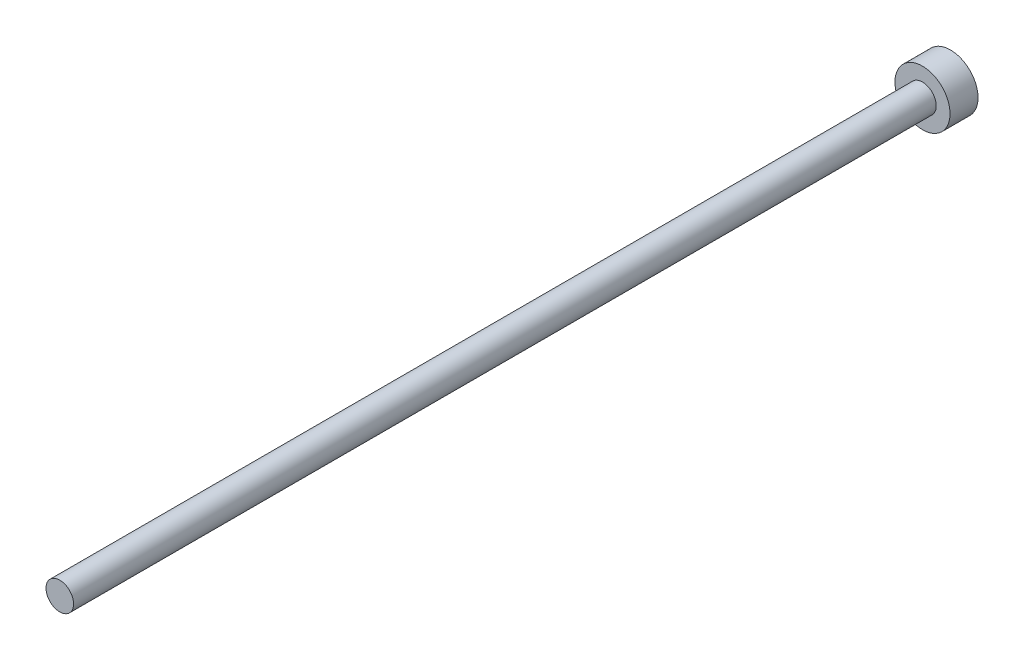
from build123d import *

# Parameters (mm, degrees)
ESQUISSE1_R      = 1.5
EXTRUSION1_DEPTH = 93.95
ESQUISSE2_R      = 3
EXTRUSION2_DEPTH = 3.05


with BuildPart() as part:
    # Esquisse1 → Extrusion1 (new body)
    with BuildSketch(Plane.XY):
        Circle(ESQUISSE1_R)
    extrude(amount=EXTRUSION1_DEPTH)

    # Esquisse2 → Extrusion2 (add)
    with BuildSketch(Plane(origin=(0, 0, 0), x_dir=(-1, 0, 0), z_dir=(0, 0, -1))):
        Circle(ESQUISSE2_R)
    extrude(amount=EXTRUSION2_DEPTH)


solid = part.part
